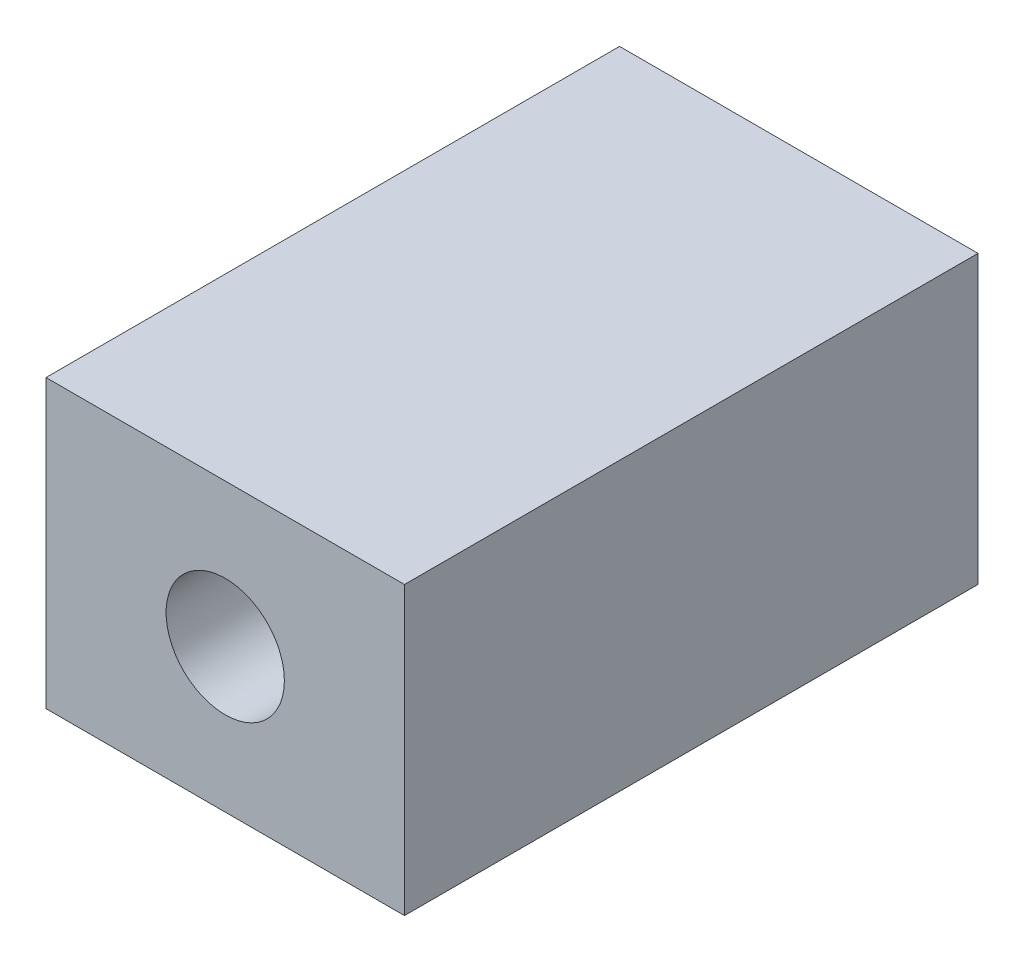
from build123d import *

# Parameters (mm, degrees)
SKETCH_1_W         = 10
SKETCH_1_H         = 8
EXTRUDE_1_DEPTH    = 16
HOLE_WIZARD_M4_1_D = 3.3


with BuildPart() as part:
    # Sketch 1 → Extrude 1 (new body)
    with BuildSketch(Plane.XY):
        Rectangle(SKETCH_1_W, SKETCH_1_H)
    extrude(amount=EXTRUDE_1_DEPTH)

    # Hole Wizard M4 _1 (through all)
    with Locations(Plane.XY.offset(16)):
        with Locations((0, 0)):
            Hole(HOLE_WIZARD_M4_1_D / 2)


solid = part.part
